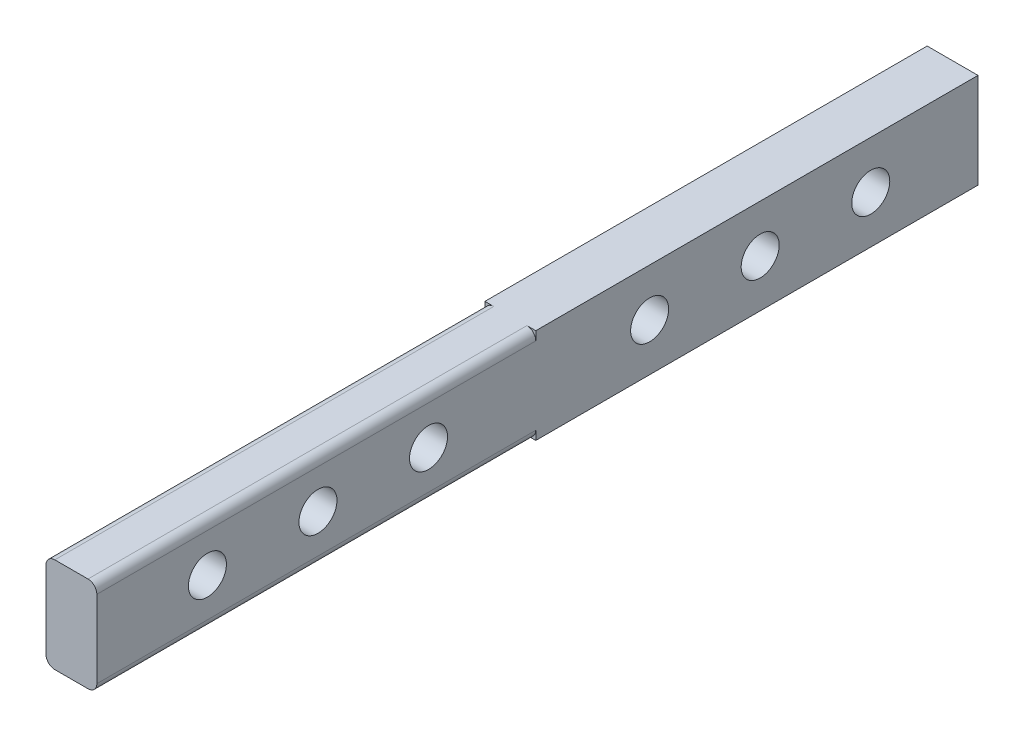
from build123d import *

# Parameters (mm, degrees)
SKETCH_1_W          = 5.75
SKETCH_1_H          = 10.75
EXTRUDE_1_DEPTH     = 49.626419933
FILLET_1_R          = 1
SKETCH_1_2_W        = 5.75
SKETCH_1_2_H        = 10.75
EXTRUDE_2_DEPTH     = 50
SKETCH_2_R          = 2.15
CUT_EXTRUDE_1_DEPTH = 51.615739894


with BuildPart() as part:
    # Sketch 1 → Extrude 1 (new body)
    with BuildSketch(Plane.XY):
        Rectangle(SKETCH_1_W, SKETCH_1_H)
    extrude(amount=EXTRUDE_1_DEPTH)

    # Fillet 1
    fillet_1_edges = [part.edges().sort_by_distance(p)[0] for p in [
        (2.875, -5.375, 24.813209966),
        (-2.875, -5.375, 24.813209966),
        (-2.875, 5.375, 24.813209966),
        (2.875, 5.375, 24.813209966),
    ]]
    fillet(fillet_1_edges, radius=FILLET_1_R)

    # Sketch 1_2 → Extrude 2 (add)
    with BuildSketch(Plane.XY):
        Rectangle(SKETCH_1_2_W, SKETCH_1_2_H)
    extrude(amount=-EXTRUDE_2_DEPTH)

    # Sketch 2 → Cut-Extrude 1 (cut, through all)
    with BuildSketch(Plane(origin=(2.875, 0, 0), x_dir=(0, 0, -1), z_dir=(1, 0, 0))):
        with Locations((-37.126419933, 0)):
            Circle(SKETCH_2_R)
        with Locations((-24.626419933, 0)):
            Circle(SKETCH_2_R)
        with Locations((-12.126419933, 0)):
            Circle(SKETCH_2_R)
        with Locations((12.873580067, 0)):
            Circle(SKETCH_2_R)
        with Locations((25.373580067, 0)):
            Circle(SKETCH_2_R)
        with Locations((37.873580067, 0)):
            Circle(SKETCH_2_R)
    extrude(amount=-CUT_EXTRUDE_1_DEPTH, mode=Mode.SUBTRACT)


solid = part.part
